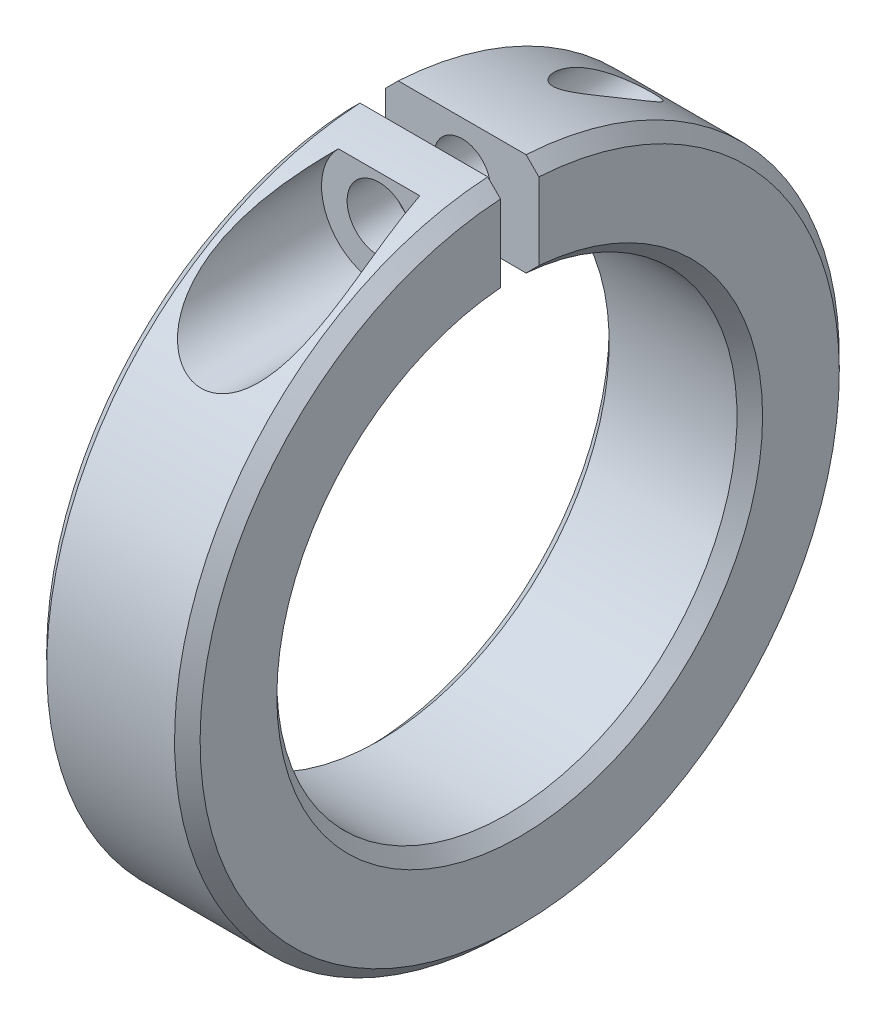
ISO-10303-21;
HEADER;
FILE_DESCRIPTION(('STEP AP214'),'2;1');
FILE_NAME('part.step','',(''),(''),'','','');
FILE_SCHEMA(('AUTOMOTIVE_DESIGN { 1 0 10303 214 1 1 1 1 }'));
ENDSEC;
DATA;
#1=APPLICATION_CONTEXT('core data for automotive mechanical design processes');
#2=APPLICATION_PROTOCOL_DEFINITION('international standard','automotive_design',2000,#1);
#3=PRODUCT_CONTEXT('',#1,'mechanical');
#4=PRODUCT('Part','Part','',(#3));
#5=PRODUCT_RELATED_PRODUCT_CATEGORY('part','',(#4));
#6=PRODUCT_DEFINITION_FORMATION('','',#4);
#7=PRODUCT_DEFINITION_CONTEXT('part definition',#1,'design');
#8=PRODUCT_DEFINITION('design','',#6,#7);
#9=PRODUCT_DEFINITION_SHAPE('','',#8);
#10=(LENGTH_UNIT() NAMED_UNIT(*) SI_UNIT(.MILLI.,.METRE.));
#11=(NAMED_UNIT(*) PLANE_ANGLE_UNIT() SI_UNIT($,.RADIAN.));
#12=(NAMED_UNIT(*) SI_UNIT($,.STERADIAN.) SOLID_ANGLE_UNIT());
#13=UNCERTAINTY_MEASURE_WITH_UNIT(LENGTH_MEASURE(1.E-05),#10,'distance_accuracy_value','');
#14=(GEOMETRIC_REPRESENTATION_CONTEXT(3) GLOBAL_UNCERTAINTY_ASSIGNED_CONTEXT((#13)) GLOBAL_UNIT_ASSIGNED_CONTEXT((#10,
#11,#12)) REPRESENTATION_CONTEXT('',''));
#15=CARTESIAN_POINT('',(0.,0.,0.));
#16=DIRECTION('',(0.,0.,1.));
#17=DIRECTION('',(1.,0.,0.));
#18=AXIS2_PLACEMENT_3D('',#15,#16,#17);
#19=CARTESIAN_POINT('',(6.,0.,0.));
#20=DIRECTION('',(1.,0.,0.));
#21=DIRECTION('',(0.,0.,-1.));
#22=AXIS2_PLACEMENT_3D('',#19,#20,#21);
#23=CONICAL_SURFACE('',#22,9.5,0.785398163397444);
#24=CARTESIAN_POINT('',(5.5,0.,0.));
#25=DIRECTION('',(-1.,0.,0.));
#26=DIRECTION('',(0.,0.,1.));
#27=AXIS2_PLACEMENT_3D('',#24,#25,#26);
#28=CIRCLE('',#27,9.);
#29=CARTESIAN_POINT('',(5.5,8.96869555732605,-0.750000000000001));
#30=VERTEX_POINT('',#29);
#31=CARTESIAN_POINT('',(5.5,8.96869555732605,0.749999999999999));
#32=VERTEX_POINT('',#31);
#33=EDGE_CURVE('E101',#30,#32,#28,.T.);
#34=ORIENTED_EDGE('',*,*,#33,.T.);
#35=CARTESIAN_POINT('',(6.,9.4703484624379,0.749999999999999));
#36=CARTESIAN_POINT('',(5.91665918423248,9.38674710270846,0.749999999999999));
#37=CARTESIAN_POINT('',(5.83332210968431,9.30314201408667,0.749999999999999));
#38=CARTESIAN_POINT('',(5.66665544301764,9.13592437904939,0.749999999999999));
#39=CARTESIAN_POINT('',(5.58332585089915,9.05231183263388,0.749999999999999));
#40=CARTESIAN_POINT('',(5.5,8.96869555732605,0.749999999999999));
#41=B_SPLINE_CURVE_WITH_KNOTS('',3,(#35,#36,#37,#38,#39,#40),.UNSPECIFIED.,.F.,.F.,(4,2,4),(0.,
0.354138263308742,0.708276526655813),.UNSPECIFIED.);
#42=CARTESIAN_POINT('',(6.,9.4703484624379,0.749999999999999));
#43=VERTEX_POINT('',#42);
#44=EDGE_CURVE('E21',#43,#32,#41,.T.);
#45=ORIENTED_EDGE('',*,*,#44,.F.);
#46=CARTESIAN_POINT('',(6.,0.,0.));
#47=DIRECTION('',(1.,0.,0.));
#48=DIRECTION('',(0.,0.,-1.));
#49=AXIS2_PLACEMENT_3D('',#46,#47,#48);
#50=CIRCLE('',#49,9.5);
#51=CARTESIAN_POINT('',(6.,9.4703484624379,-0.75));
#52=VERTEX_POINT('',#51);
#53=EDGE_CURVE('E245',#52,#43,#50,.F.);
#54=ORIENTED_EDGE('',*,*,#53,.F.);
#55=CARTESIAN_POINT('',(6.,9.4703484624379,-0.750000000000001));
#56=CARTESIAN_POINT('',(5.91665918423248,9.38674710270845,-0.750000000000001));
#57=CARTESIAN_POINT('',(5.83332210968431,9.30314201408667,-0.750000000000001));
#58=CARTESIAN_POINT('',(5.66665544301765,9.13592437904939,-0.750000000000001));
#59=CARTESIAN_POINT('',(5.58332585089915,9.05231183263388,-0.750000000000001));
#60=CARTESIAN_POINT('',(5.5,8.96869555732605,-0.750000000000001));
#61=B_SPLINE_CURVE_WITH_KNOTS('',3,(#55,#56,#57,#58,#59,#60),.UNSPECIFIED.,.F.,.F.,(4,2,4),(0.,
0.354138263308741,0.708276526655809),.UNSPECIFIED.);
#62=EDGE_CURVE('E104',#52,#30,#61,.T.);
#63=ORIENTED_EDGE('',*,*,#62,.T.);
#64=EDGE_LOOP('',(#34,#45,#54,#63));
#65=FACE_BOUND('',#64,.T.);
#66=ADVANCED_FACE('F17',(#65),#23,.F.);
#67=CARTESIAN_POINT('',(6.,0.,0.));
#68=DIRECTION('',(-1.,0.,0.));
#69=DIRECTION('',(0.,0.,1.));
#70=AXIS2_PLACEMENT_3D('',#67,#68,#69);
#71=CYLINDRICAL_SURFACE('',#70,9.);
#72=ORIENTED_EDGE('',*,*,#33,.F.);
#73=DIRECTION('',(1.,0.,0.));
#74=VECTOR('',#73,1.);
#75=CARTESIAN_POINT('',(6.,8.96869555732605,-0.750000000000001));
#76=LINE('',#75,#74);
#77=CARTESIAN_POINT('',(0.499999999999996,8.96869555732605,-0.750000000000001));
#78=VERTEX_POINT('',#77);
#79=EDGE_CURVE('E127',#30,#78,#76,.F.);
#80=ORIENTED_EDGE('',*,*,#79,.T.);
#81=CARTESIAN_POINT('',(0.499999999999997,0.,0.));
#82=DIRECTION('',(-1.,0.,0.));
#83=DIRECTION('',(0.,0.,1.));
#84=AXIS2_PLACEMENT_3D('',#81,#82,#83);
#85=CIRCLE('',#84,9.);
#86=CARTESIAN_POINT('',(0.499999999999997,8.96869555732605,0.749999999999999));
#87=VERTEX_POINT('',#86);
#88=EDGE_CURVE('E108',#78,#87,#85,.T.);
#89=ORIENTED_EDGE('',*,*,#88,.T.);
#90=DIRECTION('',(1.,0.,0.));
#91=VECTOR('',#90,1.);
#92=CARTESIAN_POINT('',(6.,8.96869555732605,0.749999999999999));
#93=LINE('',#92,#91);
#94=EDGE_CURVE('E97',#87,#32,#93,.T.);
#95=ORIENTED_EDGE('',*,*,#94,.T.);
#96=EDGE_LOOP('',(#72,#80,#89,#95));
#97=FACE_BOUND('',#96,.T.);
#98=ADVANCED_FACE('F110',(#97),#71,.F.);
#99=CARTESIAN_POINT('',(3.,11.168695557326,-13.001));
#100=DIRECTION('',(0.,0.,1.));
#101=DIRECTION('',(1.,0.,0.));
#102=AXIS2_PLACEMENT_3D('',#99,#100,#101);
#103=CYLINDRICAL_SURFACE('',#102,1.25);
#104=CARTESIAN_POINT('',(3.,11.168695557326,0.750000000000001));
#105=DIRECTION('',(0.,0.,1.));
#106=DIRECTION('',(1.,0.,0.));
#107=AXIS2_PLACEMENT_3D('',#104,#105,#106);
#108=CIRCLE('',#107,1.25);
#109=CARTESIAN_POINT('',(4.25,11.168695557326,0.750000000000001));
#110=VERTEX_POINT('',#109);
#111=EDGE_CURVE('E116',#110,#110,#108,.F.);
#112=ORIENTED_EDGE('',*,*,#111,.T.);
#113=EDGE_LOOP('',(#112));
#114=FACE_BOUND('',#113,.T.);
#115=CARTESIAN_POINT('',(3.,11.168695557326,2.5));
#116=DIRECTION('',(0.,0.,1.));
#117=DIRECTION('',(1.,0.,0.));
#118=AXIS2_PLACEMENT_3D('',#115,#116,#117);
#119=CIRCLE('',#118,1.25);
#120=CARTESIAN_POINT('',(4.25,11.168695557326,2.5));
#121=VERTEX_POINT('',#120);
#122=EDGE_CURVE('E270',#121,#121,#119,.F.);
#123=ORIENTED_EDGE('',*,*,#122,.F.);
#124=EDGE_LOOP('',(#123));
#125=FACE_BOUND('',#124,.T.);
#126=ADVANCED_FACE('F181',(#114,#125),#103,.F.);
#127=CARTESIAN_POINT('',(0.,0.,0.));
#128=DIRECTION('',(-1.,0.,0.));
#129=DIRECTION('',(0.,0.,1.));
#130=AXIS2_PLACEMENT_3D('',#127,#128,#129);
#131=CONICAL_SURFACE('',#130,9.5,0.785398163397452);
#132=ORIENTED_EDGE('',*,*,#88,.F.);
#133=CARTESIAN_POINT('',(0.499999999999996,8.96869555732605,-0.750000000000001));
#134=CARTESIAN_POINT('',(0.416674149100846,9.05231183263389,-0.750000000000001));
#135=CARTESIAN_POINT('',(0.333344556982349,9.13592437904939,-0.750000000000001));
#136=CARTESIAN_POINT('',(0.166677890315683,9.30314201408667,-0.750000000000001));
#137=CARTESIAN_POINT('',(0.0833408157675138,9.38674710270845,-0.750000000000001));
#138=CARTESIAN_POINT('',(0.,9.4703484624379,-0.750000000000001));
#139=B_SPLINE_CURVE_WITH_KNOTS('',3,(#133,#134,#135,#136,#137,#138),.UNSPECIFIED.,.F.,.F.,(4,2,
4),(0.,0.354138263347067,0.708276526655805),.UNSPECIFIED.);
#140=CARTESIAN_POINT('',(0.,9.4703484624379,-0.75));
#141=VERTEX_POINT('',#140);
#142=EDGE_CURVE('E129',#78,#141,#139,.T.);
#143=ORIENTED_EDGE('',*,*,#142,.T.);
#144=CARTESIAN_POINT('',(0.,0.,0.));
#145=DIRECTION('',(-1.,0.,0.));
#146=DIRECTION('',(0.,0.,1.));
#147=AXIS2_PLACEMENT_3D('',#144,#145,#146);
#148=CIRCLE('',#147,9.5);
#149=CARTESIAN_POINT('',(0.,9.4703484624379,0.749999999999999));
#150=VERTEX_POINT('',#149);
#151=EDGE_CURVE('E166',#141,#150,#148,.T.);
#152=ORIENTED_EDGE('',*,*,#151,.T.);
#153=CARTESIAN_POINT('',(0.,9.4703484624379,0.749999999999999));
#154=CARTESIAN_POINT('',(0.083340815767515,9.38674710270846,0.749999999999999));
#155=CARTESIAN_POINT('',(0.166677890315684,9.30314201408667,0.749999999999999));
#156=CARTESIAN_POINT('',(0.333344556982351,9.13592437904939,0.749999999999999));
#157=CARTESIAN_POINT('',(0.416674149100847,9.05231183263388,0.749999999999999));
#158=CARTESIAN_POINT('',(0.499999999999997,8.96869555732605,0.749999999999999));
#159=B_SPLINE_CURVE_WITH_KNOTS('',3,(#153,#154,#155,#156,#157,#158),.UNSPECIFIED.,.F.,.F.,(4,2,
4),(0.,0.354138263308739,0.708276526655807),.UNSPECIFIED.);
#160=EDGE_CURVE('E112',#150,#87,#159,.T.);
#161=ORIENTED_EDGE('',*,*,#160,.T.);
#162=EDGE_LOOP('',(#132,#143,#152,#161));
#163=FACE_BOUND('',#162,.T.);
#164=ADVANCED_FACE('F174',(#163),#131,.F.);
#165=CARTESIAN_POINT('',(3.,11.168695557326,-13.));
#166=DIRECTION('',(0.,0.,1.));
#167=DIRECTION('',(1.,0.,0.));
#168=AXIS2_PLACEMENT_3D('',#165,#166,#167);
#169=CYLINDRICAL_SURFACE('',#168,1.1);
#170=CARTESIAN_POINT('',(3.,11.168695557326,-0.750000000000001));
#171=DIRECTION('',(0.,0.,1.));
#172=DIRECTION('',(1.,0.,0.));
#173=AXIS2_PLACEMENT_3D('',#170,#171,#172);
#174=CIRCLE('',#173,1.1);
#175=CARTESIAN_POINT('',(4.1,11.168695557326,-0.750000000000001));
#176=VERTEX_POINT('',#175);
#177=EDGE_CURVE('E211',#176,#176,#174,.T.);
#178=ORIENTED_EDGE('',*,*,#177,.T.);
#179=EDGE_LOOP('',(#178));
#180=FACE_BOUND('',#179,.T.);
#181=CARTESIAN_POINT('',(1.9,11.1686955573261,-6.652836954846));
#182=CARTESIAN_POINT('',(1.90000271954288,11.1206855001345,-6.73343688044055));
#183=CARTESIAN_POINT('',(1.9031336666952,11.0718032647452,-6.81351156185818));
#184=CARTESIAN_POINT('',(1.91647007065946,10.972548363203,-6.97222604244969));
#185=CARTESIAN_POINT('',(1.92667890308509,10.9221749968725,-7.05086513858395));
#186=CARTESIAN_POINT('',(1.95514998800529,10.8207825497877,-7.20549475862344));
#187=CARTESIAN_POINT('',(1.97335654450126,10.7697702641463,-7.28149974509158));
#188=CARTESIAN_POINT('',(2.01918181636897,10.6675665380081,-7.43042028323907));
#189=CARTESIAN_POINT('',(2.04678589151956,10.6163754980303,-7.50334044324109));
#190=CARTESIAN_POINT('',(2.10466878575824,10.5280675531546,-7.62653131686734));
#191=CARTESIAN_POINT('',(2.13243558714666,10.4907157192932,-7.6778054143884));
#192=CARTESIAN_POINT('',(2.19512615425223,10.4173572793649,-7.77704765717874));
#193=CARTESIAN_POINT('',(2.23005941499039,10.3813525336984,-7.8250113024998));
#194=CARTESIAN_POINT('',(2.30846818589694,10.3116241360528,-7.91667592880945));
#195=CARTESIAN_POINT('',(2.35203528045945,10.2779306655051,-7.96032294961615));
#196=CARTESIAN_POINT('',(2.44826888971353,10.215353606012,-8.04046765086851));
#197=CARTESIAN_POINT('',(2.50090605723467,10.1864550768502,-8.07698760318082));
#198=CARTESIAN_POINT('',(2.59425707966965,10.1454957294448,-8.12831950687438));
#199=CARTESIAN_POINT('',(2.63228464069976,10.1311433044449,-8.14618467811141));
#200=CARTESIAN_POINT('',(2.7115450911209,10.1063810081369,-8.17688518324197));
#201=CARTESIAN_POINT('',(2.75277551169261,10.0959681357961,-8.18972434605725));
#202=CARTESIAN_POINT('',(2.83787568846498,10.079841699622,-8.20956519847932));
#203=CARTESIAN_POINT('',(2.88176295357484,10.0741640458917,-8.21652228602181));
#204=CARTESIAN_POINT('',(2.9704464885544,10.0681967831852,-8.22383355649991));
#205=CARTESIAN_POINT('',(3.01524230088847,10.0679045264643,-8.22419098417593));
#206=CARTESIAN_POINT('',(3.09933622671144,10.0724674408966,-8.21860130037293));
#207=CARTESIAN_POINT('',(3.1387119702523,10.0767779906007,-8.2133212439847));
#208=CARTESIAN_POINT('',(3.21581758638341,10.0893672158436,-8.19785139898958));
#209=CARTESIAN_POINT('',(3.25354712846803,10.0976466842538,-8.1876606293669));
#210=CARTESIAN_POINT('',(3.32782255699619,10.1179501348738,-8.16255788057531));
#211=CARTESIAN_POINT('',(3.36428565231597,10.1300909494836,-8.14749831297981));
#212=CARTESIAN_POINT('',(3.43417501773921,10.157309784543,-8.11354013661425));
#213=CARTESIAN_POINT('',(3.46759989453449,10.172389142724,-8.09463977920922));
#214=CARTESIAN_POINT('',(3.55079973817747,10.2147857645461,-8.04113852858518));
#215=CARTESIAN_POINT('',(3.59802558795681,10.2439355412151,-8.00401892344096));
#216=CARTESIAN_POINT('',(3.68448708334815,10.3059541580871,-7.92400774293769));
#217=CARTESIAN_POINT('',(3.72369937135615,10.338833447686,-7.88109988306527));
#218=CARTESIAN_POINT('',(3.81491065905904,10.425835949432,-7.76592744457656));
#219=CARTESIAN_POINT('',(3.8616943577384,10.4815052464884,-7.69072651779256));
#220=CARTESIAN_POINT('',(3.9407691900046,10.5944877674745,-7.53433567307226));
#221=CARTESIAN_POINT('',(3.97303578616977,10.6518036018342,-7.45313588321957));
#222=CARTESIAN_POINT('',(4.01741474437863,10.7483028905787,-7.31292057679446));
#223=CARTESIAN_POINT('',(4.03267426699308,10.7875526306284,-7.25490671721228));
#224=CARTESIAN_POINT('',(4.05821509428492,10.8656004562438,-7.13748576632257));
#225=CARTESIAN_POINT('',(4.06849486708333,10.9043983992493,-7.07807825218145));
#226=CARTESIAN_POINT('',(4.09271135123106,11.0197716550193,-6.89818017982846));
#227=CARTESIAN_POINT('',(4.10000522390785,11.0952792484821,-6.77608245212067));
#228=CARTESIAN_POINT('',(4.09999538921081,11.2334951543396,-6.54405651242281));
#229=CARTESIAN_POINT('',(4.0943044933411,11.2966655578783,-6.43438191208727));
#230=CARTESIAN_POINT('',(4.07285593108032,11.4194282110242,-6.21390191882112));
#231=CARTESIAN_POINT('',(4.05708999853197,11.4790174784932,-6.10309567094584));
#232=CARTESIAN_POINT('',(4.01617063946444,11.5943018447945,-5.88114128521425));
#233=CARTESIAN_POINT('',(3.99101244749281,11.6499949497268,-5.76999300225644));
#234=CARTESIAN_POINT('',(3.93135806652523,11.7572053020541,-5.54826553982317));
#235=CARTESIAN_POINT('',(3.89686981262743,11.8087260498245,-5.43768595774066));
#236=CARTESIAN_POINT('',(3.83763343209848,11.8823768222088,-5.27377148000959));
#237=CARTESIAN_POINT('',(3.81678026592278,11.9061935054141,-5.21976842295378));
#238=CARTESIAN_POINT('',(3.77227666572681,11.9526765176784,-5.11242985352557));
#239=CARTESIAN_POINT('',(3.74862693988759,11.9753431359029,-5.05909417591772));
#240=CARTESIAN_POINT('',(3.69812231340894,12.0194304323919,-4.95344003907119));
#241=CARTESIAN_POINT('',(3.67126805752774,12.0408513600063,-4.90112137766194));
#242=CARTESIAN_POINT('',(3.61370115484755,12.0822760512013,-4.7980911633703));
#243=CARTESIAN_POINT('',(3.58299171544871,12.1022809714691,-4.74737831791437));
#244=CARTESIAN_POINT('',(3.51644177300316,12.1406930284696,-4.64827023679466));
#245=CARTESIAN_POINT('',(3.48057126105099,12.1590897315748,-4.59989093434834));
#246=CARTESIAN_POINT('',(3.40213327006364,12.1934521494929,-4.50800149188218));
#247=CARTESIAN_POINT('',(3.35960374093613,12.2094306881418,-4.46446601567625));
#248=CARTESIAN_POINT('',(3.2925001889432,12.2292923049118,-4.40961691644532));
#249=CARTESIAN_POINT('',(3.27178011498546,12.2348235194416,-4.39423738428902));
#250=CARTESIAN_POINT('',(3.22844281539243,12.2449440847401,-4.36595542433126));
#251=CARTESIAN_POINT('',(3.20582449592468,12.2495328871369,-4.35305443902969));
#252=CARTESIAN_POINT('',(3.15834658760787,12.2575078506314,-4.33054817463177));
#253=CARTESIAN_POINT('',(3.13345971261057,12.2608759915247,-4.32099234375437));
#254=CARTESIAN_POINT('',(3.08219849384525,12.2659195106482,-4.30665521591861));
#255=CARTESIAN_POINT('',(3.05582877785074,12.2675998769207,-4.30185985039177));
#256=CARTESIAN_POINT('',(3.00576751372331,12.2689309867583,-4.2980618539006));
#257=CARTESIAN_POINT('',(2.98212901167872,12.2687986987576,-4.29843996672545));
#258=CARTESIAN_POINT('',(2.93535463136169,12.2670443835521,-4.30344379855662));
#259=CARTESIAN_POINT('',(2.91221934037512,12.2654207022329,-4.30807423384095));
#260=CARTESIAN_POINT('',(2.86371167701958,12.2605328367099,-4.32196652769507));
#261=CARTESIAN_POINT('',(2.83853709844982,12.2570560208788,-4.331827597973));
#262=CARTESIAN_POINT('',(2.79018080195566,12.2487791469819,-4.35517664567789));
#263=CARTESIAN_POINT('',(2.76700303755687,12.2439765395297,-4.36867160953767));
#264=CARTESIAN_POINT('',(2.70690851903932,12.2296488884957,-4.40867263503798));
#265=CARTESIAN_POINT('',(2.67187330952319,12.2191867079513,-4.43762902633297));
#266=CARTESIAN_POINT('',(2.60642873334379,12.1964613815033,-4.49971557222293));
#267=CARTESIAN_POINT('',(2.57603450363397,12.1841925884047,-4.53285876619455));
#268=CARTESIAN_POINT('',(2.50771464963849,12.153357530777,-4.61502908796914));
#269=CARTESIAN_POINT('',(2.47146759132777,12.1341998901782,-4.66521427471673));
#270=CARTESIAN_POINT('',(2.4040287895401,12.0940882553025,-4.76823968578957));
#271=CARTESIAN_POINT('',(2.37284720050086,12.0731307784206,-4.82108497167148));
#272=CARTESIAN_POINT('',(2.31435259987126,12.0296372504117,-4.92861109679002));
#273=CARTESIAN_POINT('',(2.28705954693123,12.0070938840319,-4.98329974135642));
#274=CARTESIAN_POINT('',(2.23586235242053,11.9607083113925,-5.09362726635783));
#275=CARTESIAN_POINT('',(2.21195566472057,11.9368670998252,-5.14926539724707));
#276=CARTESIAN_POINT('',(2.16565234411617,11.8864071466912,-5.26474531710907));
#277=CARTESIAN_POINT('',(2.14344874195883,11.8597082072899,-5.32462922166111));
#278=CARTESIAN_POINT('',(2.10206285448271,11.8049999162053,-5.44484566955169));
#279=CARTESIAN_POINT('',(2.08288119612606,11.7769902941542,-5.50517830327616));
#280=CARTESIAN_POINT('',(2.02956020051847,11.6910093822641,-5.68666953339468));
#281=CARTESIAN_POINT('',(1.99968865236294,11.6311348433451,-5.80820941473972));
#282=CARTESIAN_POINT('',(1.95107767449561,11.5066570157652,-6.05107335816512));
#283=CARTESIAN_POINT('',(1.93233897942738,11.442053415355,-6.17239740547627));
#284=CARTESIAN_POINT('',(1.90680447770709,11.3084950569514,-6.4138071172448));
#285=CARTESIAN_POINT('',(1.89999598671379,11.2395450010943,-6.53389396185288));
#286=CARTESIAN_POINT('',(1.9,11.1686955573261,-6.652836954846));
#287=B_SPLINE_CURVE_WITH_KNOTS('',3,(#181,#182,#183,#184,#185,#186,#187,#188,#189,#190,#191,
#192,#193,#194,#195,#196,#197,#198,#199,#200,#201,#202,#203,#204,#205,#206,#207,#208,#209,#210,
#211,#212,#213,#214,#215,#216,#217,#218,#219,#220,#221,#222,#223,#224,#225,#226,#227,#228,#229,
#230,#231,#232,#233,#234,#235,#236,#237,#238,#239,#240,#241,#242,#243,#244,#245,#246,#247,#248,
#249,#250,#251,#252,#253,#254,#255,#256,#257,#258,#259,#260,#261,#262,#263,#264,#265,#266,#267,
#268,#269,#270,#271,#272,#273,#274,#275,#276,#277,#278,#279,#280,#281,#282,#283,#284,#285,#286),
.UNSPECIFIED.,.T.,.F.,(4,2,2,2,2,2,2,2,2,2,2,2,2,2,2,2,2,2,2,2,2,2,2,2,2,2,2,2,2,2,2,2,2,2,2,2,
2,2,2,2,2,2,2,2,2,2,2,2,2,2,2,2,4),(0.,0.281365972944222,0.562866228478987,0.842436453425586,
1.1215731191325,1.32894870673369,1.53660084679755,1.74658653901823,1.95590513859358,
2.08861972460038,2.22123300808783,2.35484306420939,2.48838742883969,2.6077162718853,
2.72706896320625,2.85044553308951,2.97387840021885,3.17303416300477,3.3727623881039,
3.68484292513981,3.9974489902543,4.21231561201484,4.42724828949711,4.85736783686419,
5.23700519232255,5.61695442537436,5.99709669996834,6.37691667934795,6.56464997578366,
6.75233583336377,6.93998399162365,7.12747705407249,7.3161079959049,7.50370062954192,
7.58272183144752,7.66178888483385,7.74197972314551,7.82193286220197,7.89240889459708,
7.96296318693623,8.0442902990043,8.12577489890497,8.26491030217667,8.40449023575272,
8.59844457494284,8.79278304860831,8.98808559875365,9.18324051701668,9.39081970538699,
9.59844190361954,10.0140743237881,10.4297341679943,10.8449518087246),.UNSPECIFIED.);
#288=CARTESIAN_POINT('',(1.9,11.1686955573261,-6.652836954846));
#289=VERTEX_POINT('',#288);
#290=EDGE_CURVE('E126',#289,#289,#287,.T.);
#291=ORIENTED_EDGE('',*,*,#290,.F.);
#292=EDGE_LOOP('',(#291));
#293=FACE_BOUND('',#292,.T.);
#294=ADVANCED_FACE('F168',(#180,#293),#169,.F.);
#295=CARTESIAN_POINT('',(6.,12.9783473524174,-0.75));
#296=DIRECTION('',(0.,0.,-1.));
#297=DIRECTION('',(0.,1.,0.));
#298=AXIS2_PLACEMENT_3D('',#295,#296,#297);
#299=PLANE('',#298);
#300=CARTESIAN_POINT('',(0.,12.4774797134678,-0.75));
#301=CARTESIAN_POINT('',(0.0833304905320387,12.5609604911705,-0.75));
#302=CARTESIAN_POINT('',(0.166662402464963,12.6444398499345,-0.75));
#303=CARTESIAN_POINT('',(0.333329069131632,12.8113957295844,-0.75));
#304=CARTESIAN_POINT('',(0.416663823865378,12.8948722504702,-0.75));
#305=CARTESIAN_POINT('',(0.500000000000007,12.9783473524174,-0.75));
#306=B_SPLINE_CURVE_WITH_KNOTS('',3,(#300,#301,#302,#303,#304,#305),.UNSPECIFIED.,.F.,.F.,(4,2,
4),(0.,0.35386028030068,0.707720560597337),.UNSPECIFIED.);
#307=CARTESIAN_POINT('',(0.,12.4774797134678,-0.75));
#308=VERTEX_POINT('',#307);
#309=CARTESIAN_POINT('',(0.500000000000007,12.9783473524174,-0.750000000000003));
#310=VERTEX_POINT('',#309);
#311=EDGE_CURVE('E197',#308,#310,#306,.T.);
#312=ORIENTED_EDGE('',*,*,#311,.F.);
#313=DIRECTION('',(0.,1.,0.));
#314=VECTOR('',#313,1.);
#315=CARTESIAN_POINT('',(0.,0.,-0.75));
#316=LINE('',#315,#314);
#317=EDGE_CURVE('E165',#308,#141,#316,.F.);
#318=ORIENTED_EDGE('',*,*,#317,.T.);
#319=ORIENTED_EDGE('',*,*,#142,.F.);
#320=ORIENTED_EDGE('',*,*,#79,.F.);
#321=ORIENTED_EDGE('',*,*,#62,.F.);
#322=DIRECTION('',(0.,1.,0.));
#323=VECTOR('',#322,1.);
#324=CARTESIAN_POINT('',(6.,0.,-0.75));
#325=LINE('',#324,#323);
#326=CARTESIAN_POINT('',(6.,12.4774797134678,-0.75));
#327=VERTEX_POINT('',#326);
#328=EDGE_CURVE('E244',#327,#52,#325,.F.);
#329=ORIENTED_EDGE('',*,*,#328,.F.);
#330=CARTESIAN_POINT('',(5.50000000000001,12.9783473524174,-0.75));
#331=CARTESIAN_POINT('',(5.58333617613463,12.8948722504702,-0.75));
#332=CARTESIAN_POINT('',(5.66667093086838,12.8113957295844,-0.75));
#333=CARTESIAN_POINT('',(5.83333759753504,12.6444398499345,-0.75));
#334=CARTESIAN_POINT('',(5.91666950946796,12.5609604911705,-0.75));
#335=CARTESIAN_POINT('',(6.,12.4774797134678,-0.75));
#336=B_SPLINE_CURVE_WITH_KNOTS('',3,(#330,#331,#332,#333,#334,#335),.UNSPECIFIED.,.F.,.F.,(4,2,
4),(0.,0.353860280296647,0.707720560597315),.UNSPECIFIED.);
#337=CARTESIAN_POINT('',(5.50000000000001,12.9783473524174,-0.750000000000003));
#338=VERTEX_POINT('',#337);
#339=EDGE_CURVE('E206',#338,#327,#336,.T.);
#340=ORIENTED_EDGE('',*,*,#339,.F.);
#341=DIRECTION('',(-1.,0.,0.));
#342=VECTOR('',#341,1.);
#343=CARTESIAN_POINT('',(6.,12.9783473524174,-0.750000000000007));
#344=LINE('',#343,#342);
#345=EDGE_CURVE('E122',#310,#338,#344,.F.);
#346=ORIENTED_EDGE('',*,*,#345,.F.);
#347=EDGE_LOOP('',(#312,#318,#319,#320,#321,#329,#340,#346));
#348=FACE_BOUND('',#347,.T.);
#349=ORIENTED_EDGE('',*,*,#177,.F.);
#350=EDGE_LOOP('',(#349));
#351=FACE_BOUND('',#350,.T.);
#352=ADVANCED_FACE('F173',(#348,#351),#299,.F.);
#353=CARTESIAN_POINT('',(6.,0.,0.));
#354=DIRECTION('',(1.,0.,0.));
#355=DIRECTION('',(0.,0.,-1.));
#356=AXIS2_PLACEMENT_3D('',#353,#354,#355);
#357=PLANE('',#356);
#358=ORIENTED_EDGE('',*,*,#328,.T.);
#359=ORIENTED_EDGE('',*,*,#53,.T.);
#360=DIRECTION('',(0.,-1.,0.));
#361=VECTOR('',#360,1.);
#362=CARTESIAN_POINT('',(6.,12.9783473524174,0.75));
#363=LINE('',#362,#361);
#364=CARTESIAN_POINT('',(6.,12.4774797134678,0.75));
#365=VERTEX_POINT('',#364);
#366=EDGE_CURVE('E100',#43,#365,#363,.F.);
#367=ORIENTED_EDGE('',*,*,#366,.T.);
#368=CARTESIAN_POINT('',(6.,0.,0.));
#369=DIRECTION('',(-1.,0.,0.));
#370=DIRECTION('',(0.,0.,1.));
#371=AXIS2_PLACEMENT_3D('',#368,#369,#370);
#372=CIRCLE('',#371,12.5);
#373=EDGE_CURVE('E125',#327,#365,#372,.T.);
#374=ORIENTED_EDGE('',*,*,#373,.F.);
#375=EDGE_LOOP('',(#358,#359,#367,#374));
#376=FACE_BOUND('',#375,.T.);
#377=ADVANCED_FACE('F231',(#376),#357,.T.);
#378=CARTESIAN_POINT('',(6.,12.9783473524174,0.75));
#379=DIRECTION('',(0.,0.,1.));
#380=DIRECTION('',(0.,-1.,0.));
#381=AXIS2_PLACEMENT_3D('',#378,#379,#380);
#382=PLANE('',#381);
#383=CARTESIAN_POINT('',(0.500000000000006,12.9783473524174,0.75));
#384=CARTESIAN_POINT('',(0.416663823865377,12.8948722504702,0.75));
#385=CARTESIAN_POINT('',(0.333329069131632,12.8113957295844,0.75));
#386=CARTESIAN_POINT('',(0.166662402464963,12.6444398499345,0.75));
#387=CARTESIAN_POINT('',(0.0833304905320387,12.5609604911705,0.75));
#388=CARTESIAN_POINT('',(0.,12.4774797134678,0.75));
#389=B_SPLINE_CURVE_WITH_KNOTS('',3,(#383,#384,#385,#386,#387,#388),.UNSPECIFIED.,.F.,.F.,(4,2,
4),(0.,0.353860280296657,0.707720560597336),.UNSPECIFIED.);
#390=CARTESIAN_POINT('',(0.500000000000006,12.9783473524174,0.75));
#391=VERTEX_POINT('',#390);
#392=CARTESIAN_POINT('',(0.,12.4774797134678,0.749999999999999));
#393=VERTEX_POINT('',#392);
#394=EDGE_CURVE('E223',#391,#393,#389,.T.);
#395=ORIENTED_EDGE('',*,*,#394,.F.);
#396=DIRECTION('',(-1.,0.,0.));
#397=VECTOR('',#396,1.);
#398=CARTESIAN_POINT('',(6.,12.9783473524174,0.75));
#399=LINE('',#398,#397);
#400=CARTESIAN_POINT('',(5.50000000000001,12.9783473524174,0.75));
#401=VERTEX_POINT('',#400);
#402=EDGE_CURVE('E253',#401,#391,#399,.T.);
#403=ORIENTED_EDGE('',*,*,#402,.F.);
#404=CARTESIAN_POINT('',(6.,12.4774797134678,0.75));
#405=CARTESIAN_POINT('',(5.91666950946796,12.5609604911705,0.75));
#406=CARTESIAN_POINT('',(5.83333759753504,12.6444398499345,0.75));
#407=CARTESIAN_POINT('',(5.66667093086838,12.8113957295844,0.75));
#408=CARTESIAN_POINT('',(5.58333617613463,12.8948722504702,0.75));
#409=CARTESIAN_POINT('',(5.50000000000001,12.9783473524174,0.75));
#410=B_SPLINE_CURVE_WITH_KNOTS('',3,(#404,#405,#406,#407,#408,#409),.UNSPECIFIED.,.F.,.F.,(4,2,
4),(0.,0.353860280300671,0.707720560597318),.UNSPECIFIED.);
#411=EDGE_CURVE('E114',#365,#401,#410,.T.);
#412=ORIENTED_EDGE('',*,*,#411,.F.);
#413=ORIENTED_EDGE('',*,*,#366,.F.);
#414=ORIENTED_EDGE('',*,*,#44,.T.);
#415=ORIENTED_EDGE('',*,*,#94,.F.);
#416=ORIENTED_EDGE('',*,*,#160,.F.);
#417=DIRECTION('',(0.,1.,0.));
#418=VECTOR('',#417,1.);
#419=CARTESIAN_POINT('',(0.,0.,0.749999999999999));
#420=LINE('',#419,#418);
#421=EDGE_CURVE('E251',#150,#393,#420,.T.);
#422=ORIENTED_EDGE('',*,*,#421,.T.);
#423=EDGE_LOOP('',(#395,#403,#412,#413,#414,#415,#416,#422));
#424=FACE_BOUND('',#423,.T.);
#425=ORIENTED_EDGE('',*,*,#111,.F.);
#426=EDGE_LOOP('',(#425));
#427=FACE_BOUND('',#426,.T.);
#428=ADVANCED_FACE('F93',(#424,#427),#382,.F.);
#429=CARTESIAN_POINT('',(3.,11.168695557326,2.5));
#430=DIRECTION('',(0.,0.,1.));
#431=DIRECTION('',(1.,0.,0.));
#432=AXIS2_PLACEMENT_3D('',#429,#430,#431);
#433=PLANE('',#432);
#434=CARTESIAN_POINT('',(3.,11.168695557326,2.5));
#435=DIRECTION('',(0.,0.,-1.));
#436=DIRECTION('',(-1.,0.,0.));
#437=AXIS2_PLACEMENT_3D('',#434,#435,#436);
#438=CIRCLE('',#437,2.25);
#439=CARTESIAN_POINT('',(1.4066781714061,12.7573508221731,2.5));
#440=VERTEX_POINT('',#439);
#441=CARTESIAN_POINT('',(4.59332182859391,12.7573508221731,2.5));
#442=VERTEX_POINT('',#441);
#443=EDGE_CURVE('E39',#440,#442,#438,.F.);
#444=ORIENTED_EDGE('',*,*,#443,.T.);
#445=DIRECTION('',(-1.,0.,0.));
#446=VECTOR('',#445,1.);
#447=CARTESIAN_POINT('',(6.,12.7573508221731,2.5));
#448=LINE('',#447,#446);
#449=EDGE_CURVE('E145',#440,#442,#448,.F.);
#450=ORIENTED_EDGE('',*,*,#449,.F.);
#451=EDGE_LOOP('',(#444,#450));
#452=FACE_BOUND('',#451,.T.);
#453=ORIENTED_EDGE('',*,*,#122,.T.);
#454=EDGE_LOOP('',(#453));
#455=FACE_BOUND('',#454,.T.);
#456=ADVANCED_FACE('F230',(#452,#455),#433,.T.);
#457=CARTESIAN_POINT('',(3.,11.168695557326,13.));
#458=DIRECTION('',(0.,0.,-1.));
#459=DIRECTION('',(-1.,0.,0.));
#460=AXIS2_PLACEMENT_3D('',#457,#458,#459);
#461=CYLINDRICAL_SURFACE('',#460,2.25);
#462=CARTESIAN_POINT('',(4.5933218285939,12.7573508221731,2.5));
#463=CARTESIAN_POINT('',(4.62340774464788,12.7271949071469,2.65385900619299));
#464=CARTESIAN_POINT('',(4.65447839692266,12.6943029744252,2.80697926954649));
#465=CARTESIAN_POINT('',(4.71744115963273,12.623047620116,3.11178402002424));
#466=CARTESIAN_POINT('',(4.74933332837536,12.584683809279,3.26346840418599));
#467=CARTESIAN_POINT('',(4.81290146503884,12.5023406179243,3.56596829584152));
#468=CARTESIAN_POINT('',(4.84457623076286,12.4583413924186,3.71677866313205));
#469=CARTESIAN_POINT('',(4.9065485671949,12.3648217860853,4.01695069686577));
#470=CARTESIAN_POINT('',(4.93684619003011,12.3153016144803,4.16631241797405));
#471=CARTESIAN_POINT('',(5.02342548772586,12.1597646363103,4.6083507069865));
#472=CARTESIAN_POINT('',(5.07627526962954,12.0456959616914,4.8989301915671));
#473=CARTESIAN_POINT('',(5.16485251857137,11.7959674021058,5.47291096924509));
#474=CARTESIAN_POINT('',(5.20061377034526,11.6603508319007,5.7563253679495));
#475=CARTESIAN_POINT('',(5.23179224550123,11.4596176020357,6.13930010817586));
#476=CARTESIAN_POINT('',(5.23844775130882,11.4035821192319,6.24277053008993));
#477=CARTESIAN_POINT('',(5.24755971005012,11.2884033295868,6.44871466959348));
#478=CARTESIAN_POINT('',(5.24999905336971,11.2292483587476,6.55118265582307));
#479=CARTESIAN_POINT('',(5.25000137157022,11.080960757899,6.80012360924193));
#480=CARTESIAN_POINT('',(5.24488380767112,10.9902914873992,6.94570208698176));
#481=CARTESIAN_POINT('',(5.22217778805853,10.803628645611,7.23262804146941));
#482=CARTESIAN_POINT('',(5.20457990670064,10.7076311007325,7.37397223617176));
#483=CARTESIAN_POINT('',(5.15435784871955,10.5118772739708,7.65042342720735));
#484=CARTESIAN_POINT('',(5.12180112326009,10.4121396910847,7.78555545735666));
#485=CARTESIAN_POINT('',(5.03865966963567,10.2104435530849,8.04823943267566));
#486=CARTESIAN_POINT('',(4.98810582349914,10.108489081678,8.17580392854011));
#487=CARTESIAN_POINT('',(4.87541722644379,9.92161755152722,8.40115232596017));
#488=CARTESIAN_POINT('',(4.81646254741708,9.83660314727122,8.50042221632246));
#489=CARTESIAN_POINT('',(4.68140124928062,9.66971946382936,8.68978948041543));
#490=CARTESIAN_POINT('',(4.60528730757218,9.58785154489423,8.77988291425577));
#491=CARTESIAN_POINT('',(4.43310749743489,9.43017853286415,8.9490350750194));
#492=CARTESIAN_POINT('',(4.33680602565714,9.35446116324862,9.02794319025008));
#493=CARTESIAN_POINT('',(4.17796997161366,9.25065226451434,9.13388828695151));
#494=CARTESIAN_POINT('',(4.12266055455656,9.21769209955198,9.1671194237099));
#495=CARTESIAN_POINT('',(4.00743245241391,9.15577371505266,9.22896042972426));
#496=CARTESIAN_POINT('',(3.94751626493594,9.12681335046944,9.25757277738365));
#497=CARTESIAN_POINT('',(3.8012254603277,9.0641968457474,9.31895354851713));
#498=CARTESIAN_POINT('',(3.71304286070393,9.03255667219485,9.34955766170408));
#499=CARTESIAN_POINT('',(3.53059628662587,8.98009610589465,9.39995806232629));
#500=CARTESIAN_POINT('',(3.43633601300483,8.95926919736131,9.41976085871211));
#501=CARTESIAN_POINT('',(3.24382200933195,8.92982054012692,9.44768381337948));
#502=CARTESIAN_POINT('',(3.14555432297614,8.92124600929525,9.45575877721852));
#503=CARTESIAN_POINT('',(2.94850458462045,8.91712822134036,9.45964248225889));
#504=CARTESIAN_POINT('',(2.84972258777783,8.92158359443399,9.45545251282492));
#505=CARTESIAN_POINT('',(2.66086102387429,8.94249707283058,9.43567304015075));
#506=CARTESIAN_POINT('',(2.57061964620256,8.95820099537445,9.42079966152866));
#507=CARTESIAN_POINT('',(2.39480315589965,8.99973238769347,9.38113185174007));
#508=CARTESIAN_POINT('',(2.30922840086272,9.02556063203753,9.35633666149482));
#509=CARTESIAN_POINT('',(2.14051844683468,9.0872910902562,9.29640053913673));
#510=CARTESIAN_POINT('',(2.05769581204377,9.12361613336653,9.26082141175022));
#511=CARTESIAN_POINT('',(1.9002419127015,9.20378973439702,9.18114687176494));
#512=CARTESIAN_POINT('',(1.82561479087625,9.24764206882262,9.13704718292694));
#513=CARTESIAN_POINT('',(1.65198906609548,9.36294288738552,9.01913794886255));
#514=CARTESIAN_POINT('',(1.5580239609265,9.43767369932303,8.94110715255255));
#515=CARTESIAN_POINT('',(1.3885569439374,9.59417175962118,8.77297929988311));
#516=CARTESIAN_POINT('',(1.31309700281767,9.67595444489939,8.68285551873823));
#517=CARTESIAN_POINT('',(1.14910903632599,9.88001162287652,8.45094881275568));
#518=CARTESIAN_POINT('',(1.06989557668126,10.0039979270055,8.30412358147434));
#519=CARTESIAN_POINT('',(0.940990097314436,10.2508545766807,7.9974392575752));
#520=CARTESIAN_POINT('',(0.891345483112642,10.373722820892,7.83755969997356));
#521=CARTESIAN_POINT('',(0.816147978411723,10.6129685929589,7.5103648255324));
#522=CARTESIAN_POINT('',(0.79035894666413,10.7293987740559,7.34313994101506));
#523=CARTESIAN_POINT('',(0.757294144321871,10.9548407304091,7.00237353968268));
#524=CARTESIAN_POINT('',(0.75000267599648,11.0638587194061,6.82883750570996));
#525=CARTESIAN_POINT('',(0.749996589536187,11.302306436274,6.42853041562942));
#526=CARTESIAN_POINT('',(0.76183208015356,11.4291260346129,6.20022085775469));
#527=CARTESIAN_POINT('',(0.802813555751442,11.6682858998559,5.73751603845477));
#528=CARTESIAN_POINT('',(0.831978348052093,11.7806102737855,5.50311443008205));
#529=CARTESIAN_POINT('',(0.902646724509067,11.9908578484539,5.02861404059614));
#530=CARTESIAN_POINT('',(0.944202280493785,12.0887177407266,4.788495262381));
#531=CARTESIAN_POINT('',(1.03504953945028,12.2694613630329,4.30431017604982));
#532=CARTESIAN_POINT('',(1.08433750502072,12.3523522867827,4.06024582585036));
#533=CARTESIAN_POINT('',(1.18024458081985,12.49437576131,3.59749786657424));
#534=CARTESIAN_POINT('',(1.2264859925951,12.5551605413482,3.3792404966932));
#535=CARTESIAN_POINT('',(1.29524554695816,12.637566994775,3.05033803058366));
#536=CARTESIAN_POINT('',(1.31799233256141,12.6635041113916,2.94080796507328));
#537=CARTESIAN_POINT('',(1.3628926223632,12.7125504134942,2.72098121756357));
#538=CARTESIAN_POINT('',(1.38504605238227,12.7356592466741,2.61068444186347));
#539=CARTESIAN_POINT('',(1.4066781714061,12.7573508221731,2.5));
#540=B_SPLINE_CURVE_WITH_KNOTS('',3,(#462,#463,#464,#465,#466,#467,#468,#469,#470,#471,#472,
#473,#474,#475,#476,#477,#478,#479,#480,#481,#482,#483,#484,#485,#486,#487,#488,#489,#490,#491,
#492,#493,#494,#495,#496,#497,#498,#499,#500,#501,#502,#503,#504,#505,#506,#507,#508,#509,#510,
#511,#512,#513,#514,#515,#516,#517,#518,#519,#520,#521,#522,#523,#524,#525,#526,#527,#528,#529,
#530,#531,#532,#533,#534,#535,#536,#537,#538,#539),.UNSPECIFIED.,.F.,.F.,(4,2,2,2,2,2,2,2,2,2,2,
2,2,2,2,2,2,2,2,2,2,2,2,2,2,2,2,2,2,2,2,2,2,2,2,2,2,2,4),(0.,0.478899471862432,
0.957833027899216,1.43850206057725,1.91915288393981,2.86792460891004,3.81481273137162,
4.16828919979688,4.52319677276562,5.03742144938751,5.55203490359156,6.06435034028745,
6.57579087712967,7.00479515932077,7.43398286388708,7.86849018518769,8.08551305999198,
8.30241909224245,8.59677942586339,8.89096217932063,9.18627561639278,9.48155800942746,
9.75870021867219,10.0358636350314,10.3262866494,10.6168557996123,11.0440112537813,
11.4721267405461,12.0922258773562,12.7133165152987,13.328191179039,13.9425438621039,
14.7255148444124,15.5093371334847,16.2964944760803,17.0832725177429,17.7766565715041,
18.1211265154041,18.4656393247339),.UNSPECIFIED.);
#541=EDGE_CURVE('E137',#442,#440,#540,.T.);
#542=ORIENTED_EDGE('',*,*,#541,.F.);
#543=ORIENTED_EDGE('',*,*,#443,.F.);
#544=EDGE_LOOP('',(#542,#543));
#545=FACE_BOUND('',#544,.T.);
#546=ADVANCED_FACE('F147',(#545),#461,.F.);
#547=CARTESIAN_POINT('',(0.,0.,0.));
#548=DIRECTION('',(1.,0.,0.));
#549=DIRECTION('',(0.,0.,-1.));
#550=AXIS2_PLACEMENT_3D('',#547,#548,#549);
#551=PLANE('',#550);
#552=ORIENTED_EDGE('',*,*,#317,.F.);
#553=CARTESIAN_POINT('',(0.,0.,0.));
#554=DIRECTION('',(1.,0.,0.));
#555=DIRECTION('',(0.,0.,-1.));
#556=AXIS2_PLACEMENT_3D('',#553,#554,#555);
#557=CIRCLE('',#556,12.5);
#558=EDGE_CURVE('E131',#393,#308,#557,.T.);
#559=ORIENTED_EDGE('',*,*,#558,.F.);
#560=ORIENTED_EDGE('',*,*,#421,.F.);
#561=ORIENTED_EDGE('',*,*,#151,.F.);
#562=EDGE_LOOP('',(#552,#559,#560,#561));
#563=FACE_BOUND('',#562,.T.);
#564=ADVANCED_FACE('F215',(#563),#551,.F.);
#565=CARTESIAN_POINT('',(5.50000000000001,0.,0.));
#566=DIRECTION('',(-1.,0.,0.));
#567=DIRECTION('',(0.,0.,1.));
#568=AXIS2_PLACEMENT_3D('',#565,#566,#567);
#569=CONICAL_SURFACE('',#568,13.,0.785398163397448);
#570=ORIENTED_EDGE('',*,*,#373,.T.);
#571=ORIENTED_EDGE('',*,*,#411,.T.);
#572=CARTESIAN_POINT('',(5.50000000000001,0.,0.));
#573=DIRECTION('',(-1.,0.,0.));
#574=DIRECTION('',(0.,0.,1.));
#575=AXIS2_PLACEMENT_3D('',#572,#573,#574);
#576=CIRCLE('',#575,13.);
#577=EDGE_CURVE('E31',#338,#401,#576,.T.);
#578=ORIENTED_EDGE('',*,*,#577,.F.);
#579=ORIENTED_EDGE('',*,*,#339,.T.);
#580=EDGE_LOOP('',(#570,#571,#578,#579));
#581=FACE_BOUND('',#580,.T.);
#582=ADVANCED_FACE('F212',(#581),#569,.T.);
#583=CARTESIAN_POINT('',(0.500000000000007,0.,0.));
#584=DIRECTION('',(1.,0.,0.));
#585=DIRECTION('',(0.,0.,-1.));
#586=AXIS2_PLACEMENT_3D('',#583,#584,#585);
#587=CONICAL_SURFACE('',#586,13.,0.785398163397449);
#588=ORIENTED_EDGE('',*,*,#558,.T.);
#589=ORIENTED_EDGE('',*,*,#311,.T.);
#590=CARTESIAN_POINT('',(0.500000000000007,0.,0.));
#591=DIRECTION('',(-1.,0.,0.));
#592=DIRECTION('',(0.,0.,1.));
#593=AXIS2_PLACEMENT_3D('',#590,#591,#592);
#594=CIRCLE('',#593,13.);
#595=EDGE_CURVE('E11',#391,#310,#594,.F.);
#596=ORIENTED_EDGE('',*,*,#595,.F.);
#597=ORIENTED_EDGE('',*,*,#394,.T.);
#598=EDGE_LOOP('',(#588,#589,#596,#597));
#599=FACE_BOUND('',#598,.T.);
#600=ADVANCED_FACE('F155',(#599),#587,.T.);
#601=CARTESIAN_POINT('',(6.,0.,0.));
#602=DIRECTION('',(-1.,0.,0.));
#603=DIRECTION('',(0.,0.,1.));
#604=AXIS2_PLACEMENT_3D('',#601,#602,#603);
#605=CYLINDRICAL_SURFACE('',#604,13.);
#606=ORIENTED_EDGE('',*,*,#577,.T.);
#607=ORIENTED_EDGE('',*,*,#402,.T.);
#608=ORIENTED_EDGE('',*,*,#595,.T.);
#609=ORIENTED_EDGE('',*,*,#345,.T.);
#610=EDGE_LOOP('',(#606,#607,#608,#609));
#611=FACE_BOUND('',#610,.T.);
#612=ORIENTED_EDGE('',*,*,#449,.T.);
#613=ORIENTED_EDGE('',*,*,#541,.T.);
#614=EDGE_LOOP('',(#612,#613));
#615=FACE_BOUND('',#614,.T.);
#616=ORIENTED_EDGE('',*,*,#290,.T.);
#617=EDGE_LOOP('',(#616));
#618=FACE_BOUND('',#617,.T.);
#619=ADVANCED_FACE('F151',(#611,#615,#618),#605,.T.);
#620=CLOSED_SHELL('',(#66,#98,#126,#164,#294,#352,#377,#428,#456,#546,#564,#582,#600,#619));
#621=MANIFOLD_SOLID_BREP('B1',#620);
#622=ADVANCED_BREP_SHAPE_REPRESENTATION('',(#18,#621),#14);
#623=SHAPE_DEFINITION_REPRESENTATION(#9,#622);
ENDSEC;
END-ISO-10303-21;
